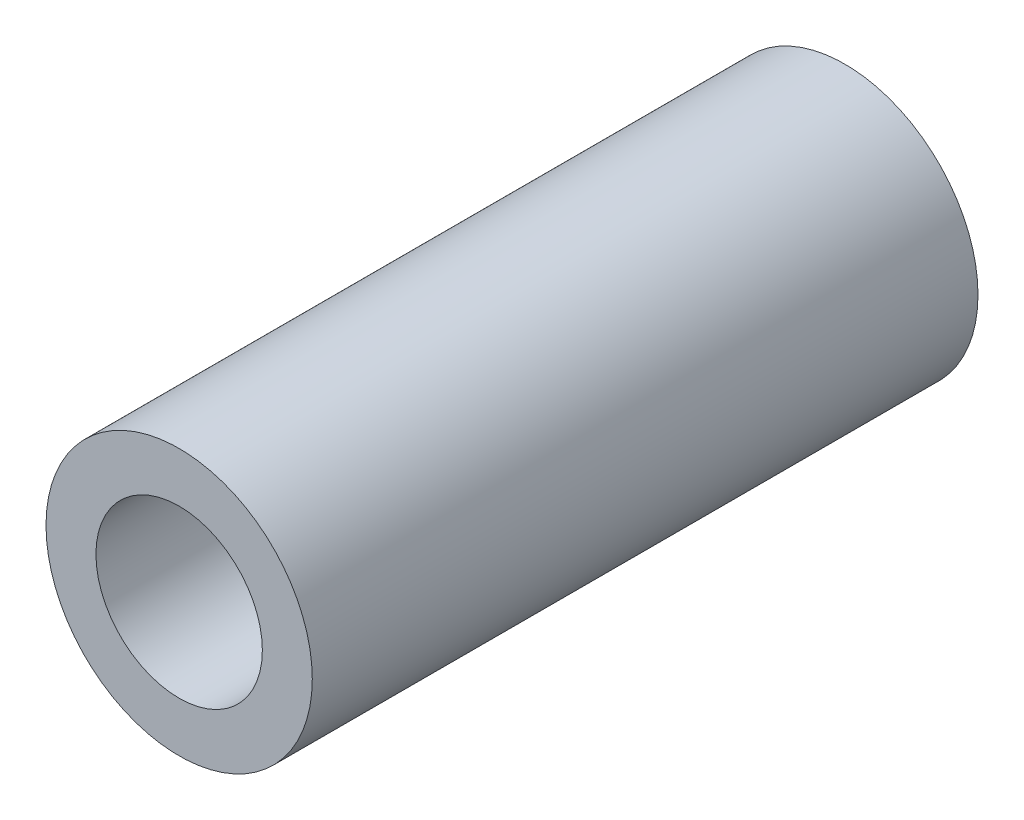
ISO-10303-21;
HEADER;
FILE_DESCRIPTION(('STEP AP214'),'2;1');
FILE_NAME('part.step','',(''),(''),'','','');
FILE_SCHEMA(('AUTOMOTIVE_DESIGN { 1 0 10303 214 1 1 1 1 }'));
ENDSEC;
DATA;
#1=APPLICATION_CONTEXT('core data for automotive mechanical design processes');
#2=APPLICATION_PROTOCOL_DEFINITION('international standard','automotive_design',2000,#1);
#3=PRODUCT_CONTEXT('',#1,'mechanical');
#4=PRODUCT('Part','Part','',(#3));
#5=PRODUCT_RELATED_PRODUCT_CATEGORY('part','',(#4));
#6=PRODUCT_DEFINITION_FORMATION('','',#4);
#7=PRODUCT_DEFINITION_CONTEXT('part definition',#1,'design');
#8=PRODUCT_DEFINITION('design','',#6,#7);
#9=PRODUCT_DEFINITION_SHAPE('','',#8);
#10=(LENGTH_UNIT() NAMED_UNIT(*) SI_UNIT(.MILLI.,.METRE.));
#11=(NAMED_UNIT(*) PLANE_ANGLE_UNIT() SI_UNIT($,.RADIAN.));
#12=(NAMED_UNIT(*) SI_UNIT($,.STERADIAN.) SOLID_ANGLE_UNIT());
#13=UNCERTAINTY_MEASURE_WITH_UNIT(LENGTH_MEASURE(1.E-05),#10,'distance_accuracy_value','');
#14=(GEOMETRIC_REPRESENTATION_CONTEXT(3) GLOBAL_UNCERTAINTY_ASSIGNED_CONTEXT((#13)) GLOBAL_UNIT_ASSIGNED_CONTEXT((#10,
#11,#12)) REPRESENTATION_CONTEXT('',''));
#15=CARTESIAN_POINT('',(0.,0.,0.));
#16=DIRECTION('',(0.,0.,1.));
#17=DIRECTION('',(1.,0.,0.));
#18=AXIS2_PLACEMENT_3D('',#15,#16,#17);
#19=CARTESIAN_POINT('',(0.,0.,25.4));
#20=DIRECTION('',(0.,0.,-1.));
#21=DIRECTION('',(-1.,0.,0.));
#22=AXIS2_PLACEMENT_3D('',#19,#20,#21);
#23=CYLINDRICAL_SURFACE('',#22,5.08);
#24=CARTESIAN_POINT('',(0.,0.,25.4));
#25=DIRECTION('',(0.,0.,1.));
#26=DIRECTION('',(1.,0.,0.));
#27=AXIS2_PLACEMENT_3D('',#24,#25,#26);
#28=CIRCLE('',#27,5.08);
#29=CARTESIAN_POINT('',(5.08,0.,25.4));
#30=VERTEX_POINT('',#29);
#31=EDGE_CURVE('E10',#30,#30,#28,.T.);
#32=ORIENTED_EDGE('',*,*,#31,.F.);
#33=EDGE_LOOP('',(#32));
#34=FACE_BOUND('',#33,.T.);
#35=CARTESIAN_POINT('',(0.,0.,0.));
#36=DIRECTION('',(0.,0.,1.));
#37=DIRECTION('',(1.,0.,0.));
#38=AXIS2_PLACEMENT_3D('',#35,#36,#37);
#39=CIRCLE('',#38,5.08);
#40=CARTESIAN_POINT('',(5.08,0.,0.));
#41=VERTEX_POINT('',#40);
#42=EDGE_CURVE('E34',#41,#41,#39,.T.);
#43=ORIENTED_EDGE('',*,*,#42,.T.);
#44=EDGE_LOOP('',(#43));
#45=FACE_BOUND('',#44,.T.);
#46=ADVANCED_FACE('F31',(#34,#45),#23,.T.);
#47=CARTESIAN_POINT('',(0.,0.,25.4));
#48=DIRECTION('',(0.,0.,1.));
#49=DIRECTION('',(1.,0.,0.));
#50=AXIS2_PLACEMENT_3D('',#47,#48,#49);
#51=PLANE('',#50);
#52=CARTESIAN_POINT('',(0.,0.,25.4));
#53=DIRECTION('',(0.,0.,1.));
#54=DIRECTION('',(1.,0.,0.));
#55=AXIS2_PLACEMENT_3D('',#52,#53,#54);
#56=CIRCLE('',#55,3.175);
#57=CARTESIAN_POINT('',(3.175,0.,25.4));
#58=VERTEX_POINT('',#57);
#59=EDGE_CURVE('E43',#58,#58,#56,.T.);
#60=ORIENTED_EDGE('',*,*,#59,.F.);
#61=EDGE_LOOP('',(#60));
#62=FACE_BOUND('',#61,.T.);
#63=ORIENTED_EDGE('',*,*,#31,.T.);
#64=EDGE_LOOP('',(#63));
#65=FACE_BOUND('',#64,.T.);
#66=ADVANCED_FACE('F58',(#62,#65),#51,.T.);
#67=CARTESIAN_POINT('',(0.,0.,0.));
#68=DIRECTION('',(0.,0.,1.));
#69=DIRECTION('',(1.,0.,0.));
#70=AXIS2_PLACEMENT_3D('',#67,#68,#69);
#71=PLANE('',#70);
#72=CARTESIAN_POINT('',(0.,0.,0.));
#73=DIRECTION('',(0.,0.,1.));
#74=DIRECTION('',(1.,0.,0.));
#75=AXIS2_PLACEMENT_3D('',#72,#73,#74);
#76=CIRCLE('',#75,3.175);
#77=CARTESIAN_POINT('',(3.175,0.,0.));
#78=VERTEX_POINT('',#77);
#79=EDGE_CURVE('E41',#78,#78,#76,.T.);
#80=ORIENTED_EDGE('',*,*,#79,.T.);
#81=EDGE_LOOP('',(#80));
#82=FACE_BOUND('',#81,.T.);
#83=ORIENTED_EDGE('',*,*,#42,.F.);
#84=EDGE_LOOP('',(#83));
#85=FACE_BOUND('',#84,.T.);
#86=ADVANCED_FACE('F49',(#82,#85),#71,.F.);
#87=CARTESIAN_POINT('',(0.,0.,0.));
#88=DIRECTION('',(0.,0.,1.));
#89=DIRECTION('',(1.,0.,0.));
#90=AXIS2_PLACEMENT_3D('',#87,#88,#89);
#91=CYLINDRICAL_SURFACE('',#90,3.175);
#92=ORIENTED_EDGE('',*,*,#79,.F.);
#93=EDGE_LOOP('',(#92));
#94=FACE_BOUND('',#93,.T.);
#95=ORIENTED_EDGE('',*,*,#59,.T.);
#96=EDGE_LOOP('',(#95));
#97=FACE_BOUND('',#96,.T.);
#98=ADVANCED_FACE('F52',(#94,#97),#91,.F.);
#99=CLOSED_SHELL('',(#46,#66,#86,#98));
#100=MANIFOLD_SOLID_BREP('B2',#99);
#101=ADVANCED_BREP_SHAPE_REPRESENTATION('',(#18,#100),#14);
#102=SHAPE_DEFINITION_REPRESENTATION(#9,#101);
ENDSEC;
END-ISO-10303-21;
